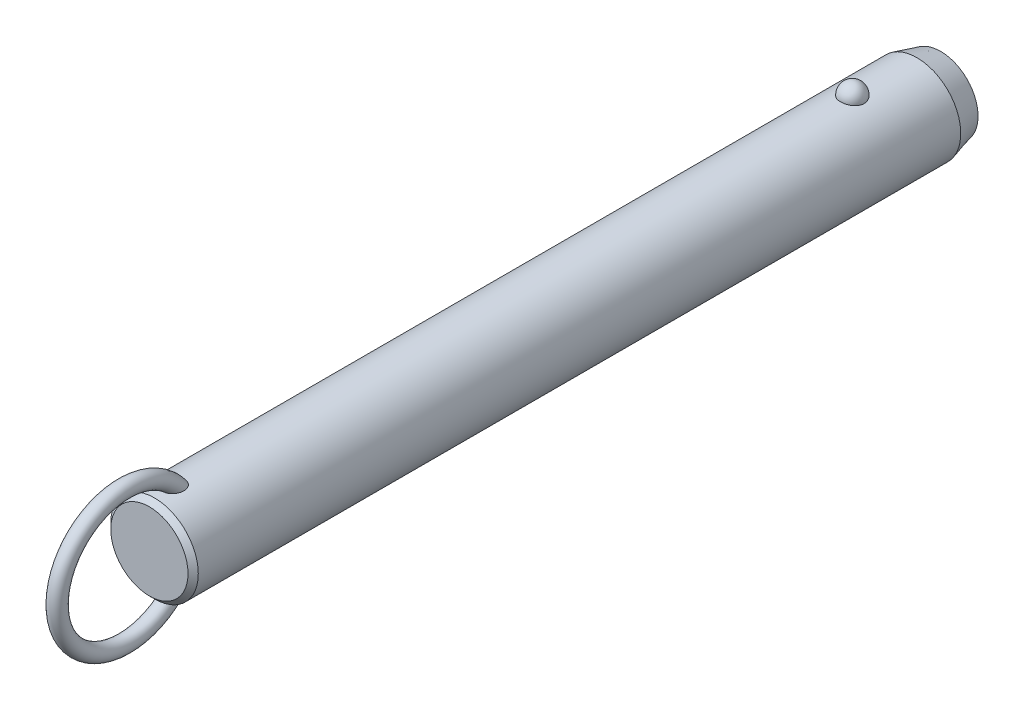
ISO-10303-21;
HEADER;
FILE_DESCRIPTION(('STEP AP214'),'2;1');
FILE_NAME('part.step','',(''),(''),'','','');
FILE_SCHEMA(('AUTOMOTIVE_DESIGN { 1 0 10303 214 1 1 1 1 }'));
ENDSEC;
DATA;
#1=APPLICATION_CONTEXT('core data for automotive mechanical design processes');
#2=APPLICATION_PROTOCOL_DEFINITION('international standard','automotive_design',2000,#1);
#3=PRODUCT_CONTEXT('',#1,'mechanical');
#4=PRODUCT('Part','Part','',(#3));
#5=PRODUCT_RELATED_PRODUCT_CATEGORY('part','',(#4));
#6=PRODUCT_DEFINITION_FORMATION('','',#4);
#7=PRODUCT_DEFINITION_CONTEXT('part definition',#1,'design');
#8=PRODUCT_DEFINITION('design','',#6,#7);
#9=PRODUCT_DEFINITION_SHAPE('','',#8);
#10=(LENGTH_UNIT() NAMED_UNIT(*) SI_UNIT(.MILLI.,.METRE.));
#11=(NAMED_UNIT(*) PLANE_ANGLE_UNIT() SI_UNIT($,.RADIAN.));
#12=(NAMED_UNIT(*) SI_UNIT($,.STERADIAN.) SOLID_ANGLE_UNIT());
#13=UNCERTAINTY_MEASURE_WITH_UNIT(LENGTH_MEASURE(1.E-05),#10,'distance_accuracy_value','');
#14=(GEOMETRIC_REPRESENTATION_CONTEXT(3) GLOBAL_UNCERTAINTY_ASSIGNED_CONTEXT((#13)) GLOBAL_UNIT_ASSIGNED_CONTEXT((#10,
#11,#12)) REPRESENTATION_CONTEXT('',''));
#15=CARTESIAN_POINT('',(0.,0.,0.));
#16=DIRECTION('',(0.,0.,1.));
#17=DIRECTION('',(1.,0.,0.));
#18=AXIS2_PLACEMENT_3D('',#15,#16,#17);
#19=CARTESIAN_POINT('',(0.,0.,162.6));
#20=DIRECTION('',(0.,0.,-1.));
#21=DIRECTION('',(-1.,0.,0.));
#22=AXIS2_PLACEMENT_3D('',#19,#20,#21);
#23=CYLINDRICAL_SURFACE('',#22,11.1);
#24=CARTESIAN_POINT('',(2.9724815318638,10.6945945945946,-3.00000000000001));
#25=CARTESIAN_POINT('',(2.97247830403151,10.6945972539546,-2.8322505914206));
#26=CARTESIAN_POINT('',(2.95876598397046,10.6984356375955,-2.66445972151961));
#27=CARTESIAN_POINT('',(2.90424529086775,10.7133624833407,-2.3336238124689));
#28=CARTESIAN_POINT('',(2.8634252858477,10.7244540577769,-2.17058084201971));
#29=CARTESIAN_POINT('',(2.75573657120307,10.7526272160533,-1.85396767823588));
#30=CARTESIAN_POINT('',(2.68887937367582,10.7697061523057,-1.70039333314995));
#31=CARTESIAN_POINT('',(2.53079696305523,10.8079438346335,-1.4069159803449));
#32=CARTESIAN_POINT('',(2.43957264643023,10.8291024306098,-1.26701246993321));
#33=CARTESIAN_POINT('',(2.23458150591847,10.8732541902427,-1.00409565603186));
#34=CARTESIAN_POINT('',(2.12071295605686,10.8962553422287,-0.881162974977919));
#35=CARTESIAN_POINT('',(1.87365402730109,10.9414421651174,-0.656352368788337));
#36=CARTESIAN_POINT('',(1.74046358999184,10.9636278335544,-0.554474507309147));
#37=CARTESIAN_POINT('',(1.45872188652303,11.0046495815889,-0.374872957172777));
#38=CARTESIAN_POINT('',(1.31021276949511,11.0234944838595,-0.297085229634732));
#39=CARTESIAN_POINT('',(1.00170030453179,11.0557957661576,-0.167529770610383));
#40=CARTESIAN_POINT('',(0.841698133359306,11.0692526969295,-0.1157593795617));
#41=CARTESIAN_POINT('',(0.517607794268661,11.0890932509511,-0.0403925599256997));
#42=CARTESIAN_POINT('',(0.353633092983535,11.0955916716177,-0.0163383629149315));
#43=CARTESIAN_POINT('',(0.0238420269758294,11.1011989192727,0.00445177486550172));
#44=CARTESIAN_POINT('',(-0.141974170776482,11.1003084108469,0.00119017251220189));
#45=CARTESIAN_POINT('',(-0.468405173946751,11.0912990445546,-0.0323233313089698));
#46=CARTESIAN_POINT('',(-0.629059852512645,11.0832767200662,-0.062214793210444));
#47=CARTESIAN_POINT('',(-0.942937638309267,11.0609962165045,-0.147645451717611));
#48=CARTESIAN_POINT('',(-1.09616062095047,11.0467379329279,-0.203185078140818));
#49=CARTESIAN_POINT('',(-1.39181061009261,11.0134071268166,-0.338752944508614));
#50=CARTESIAN_POINT('',(-1.53417383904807,10.9943086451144,-0.418913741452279));
#51=CARTESIAN_POINT('',(-1.80342160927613,10.9533667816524,-0.601448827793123));
#52=CARTESIAN_POINT('',(-1.9303046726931,10.9315231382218,-0.703825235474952));
#53=CARTESIAN_POINT('',(-2.16747598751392,10.887005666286,-0.930091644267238));
#54=CARTESIAN_POINT('',(-2.27742774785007,10.8643239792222,-1.05433291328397));
#55=CARTESIAN_POINT('',(-2.47517316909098,10.8209886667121,-1.31966633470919));
#56=CARTESIAN_POINT('',(-2.56296538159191,10.8003351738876,-1.46075958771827));
#57=CARTESIAN_POINT('',(-2.71500300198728,10.7631304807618,-1.75753646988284));
#58=CARTESIAN_POINT('',(-2.77898901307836,10.7466250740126,-1.91335887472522));
#59=CARTESIAN_POINT('',(-2.88046189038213,10.7198747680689,-2.23391529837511));
#60=CARTESIAN_POINT('',(-2.91794947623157,10.709629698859,-2.3986490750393));
#61=CARTESIAN_POINT('',(-2.96537819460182,10.6965949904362,-2.73165170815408));
#62=CARTESIAN_POINT('',(-2.97542891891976,10.693775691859,-2.89990378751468));
#63=CARTESIAN_POINT('',(-2.96804271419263,10.6958279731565,-3.23575286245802));
#64=CARTESIAN_POINT('',(-2.95060646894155,10.7006993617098,-3.4033498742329));
#65=CARTESIAN_POINT('',(-2.88883358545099,10.71753912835,-3.73233906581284));
#66=CARTESIAN_POINT('',(-2.84462026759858,10.7294749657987,-3.89375610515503));
#67=CARTESIAN_POINT('',(-2.73050447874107,10.7590797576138,-4.20667949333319));
#68=CARTESIAN_POINT('',(-2.66060103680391,10.7767489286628,-4.35818546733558));
#69=CARTESIAN_POINT('',(-2.49642559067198,10.8159599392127,-4.64785421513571));
#70=CARTESIAN_POINT('',(-2.40203047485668,10.8375211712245,-4.78594458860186));
#71=CARTESIAN_POINT('',(-2.19143488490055,10.8820570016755,-5.04410382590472));
#72=CARTESIAN_POINT('',(-2.07523364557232,10.9050316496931,-5.16417205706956));
#73=CARTESIAN_POINT('',(-1.82361254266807,10.9499219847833,-5.3833483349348));
#74=CARTESIAN_POINT('',(-1.68812945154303,10.9718338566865,-5.48238464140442));
#75=CARTESIAN_POINT('',(-1.40191298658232,11.0120611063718,-5.65618873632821));
#76=CARTESIAN_POINT('',(-1.25118062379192,11.0303767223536,-5.73095813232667));
#77=CARTESIAN_POINT('',(-0.940570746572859,11.0611653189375,-5.85334725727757));
#78=CARTESIAN_POINT('',(-0.780821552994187,11.0737044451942,-5.90127578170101));
#79=CARTESIAN_POINT('',(-0.455204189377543,11.0918598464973,-5.96992976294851));
#80=CARTESIAN_POINT('',(-0.289336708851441,11.0974768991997,-5.99065827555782));
#81=CARTESIAN_POINT('',(0.0406846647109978,11.1011307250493,-6.00418773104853));
#82=CARTESIAN_POINT('',(0.204817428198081,11.099299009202,-5.9974731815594));
#83=CARTESIAN_POINT('',(0.5295530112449,11.088551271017,-5.95740317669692));
#84=CARTESIAN_POINT('',(0.69015594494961,11.0796354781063,-5.92404858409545));
#85=CARTESIAN_POINT('',(1.0027760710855,11.0557204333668,-5.83180084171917));
#86=CARTESIAN_POINT('',(1.15482001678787,11.0407414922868,-5.7729929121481));
#87=CARTESIAN_POINT('',(1.44678373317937,11.0062913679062,-5.63147366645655));
#88=CARTESIAN_POINT('',(1.58670279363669,10.9868199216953,-5.54876095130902));
#89=CARTESIAN_POINT('',(1.8527023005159,10.9451315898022,-5.36027644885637));
#90=CARTESIAN_POINT('',(1.97855158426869,10.9228788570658,-5.25418644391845));
#91=CARTESIAN_POINT('',(2.21080872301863,10.8782509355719,-5.02251354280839));
#92=CARTESIAN_POINT('',(2.31721312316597,10.8558757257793,-4.89692718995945));
#93=CARTESIAN_POINT('',(2.5094551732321,10.8130715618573,-4.62745408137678));
#94=CARTESIAN_POINT('',(2.59493284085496,10.7926798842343,-4.48330448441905));
#95=CARTESIAN_POINT('',(2.740862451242,10.7565495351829,-4.18236358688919));
#96=CARTESIAN_POINT('',(2.80132490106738,10.7408089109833,-4.02557762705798));
#97=CARTESIAN_POINT('',(2.88959070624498,10.7173718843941,-3.72475308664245));
#98=CARTESIAN_POINT('',(2.92062102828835,10.7088950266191,-3.58171216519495));
#99=CARTESIAN_POINT('',(2.96206765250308,10.6975052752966,-3.29245795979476));
#100=CARTESIAN_POINT('',(2.97248434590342,10.6945922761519,-3.14624473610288));
#101=CARTESIAN_POINT('',(2.9724815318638,10.6945945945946,-3.00000000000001));
#102=B_SPLINE_CURVE_WITH_KNOTS('',3,(#24,#25,#26,#27,#28,#29,#30,#31,#32,#33,#34,#35,#36,#37,
#38,#39,#40,#41,#42,#43,#44,#45,#46,#47,#48,#49,#50,#51,#52,#53,#54,#55,#56,#57,#58,#59,#60,#61,
#62,#63,#64,#65,#66,#67,#68,#69,#70,#71,#72,#73,#74,#75,#76,#77,#78,#79,#80,#81,#82,#83,#84,#85,
#86,#87,#88,#89,#90,#91,#92,#93,#94,#95,#96,#97,#98,#99,#100,#101),.UNSPECIFIED.,.T.,.F.,(4,2,2,
2,2,2,2,2,2,2,2,2,2,2,2,2,2,2,2,2,2,2,2,2,2,2,2,2,2,2,2,2,2,2,2,2,2,2,4),(0.,0.502722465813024,
1.00566079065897,1.5083769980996,2.01107471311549,2.51608392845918,3.02109467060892,
3.52475118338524,4.02835620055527,4.523518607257,5.0186364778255,5.50715297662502,
5.9956776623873,6.48688002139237,6.97812923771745,7.47814366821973,7.9781907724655,
8.48353712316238,8.9888697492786,9.49218093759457,9.99547960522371,10.4964777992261,
10.997494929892,11.5010810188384,12.0046847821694,12.5099796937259,13.0152411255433,
13.5145635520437,14.0138298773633,14.5043200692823,14.9947943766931,15.4836390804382,
15.9725123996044,16.4685040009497,16.9645836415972,17.4686765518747,17.972557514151,
18.410841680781,18.849117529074),.UNSPECIFIED.);
#103=CARTESIAN_POINT('',(2.9724815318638,10.6945945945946,-3.00000000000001));
#104=VERTEX_POINT('',#103);
#105=EDGE_CURVE('E41',#104,#104,#102,.T.);
#106=ORIENTED_EDGE('',*,*,#105,.T.);
#107=EDGE_LOOP('',(#106));
#108=FACE_BOUND('',#107,.T.);
#109=CARTESIAN_POINT('',(0.,0.,174.));
#110=DIRECTION('',(0.,0.,1.));
#111=DIRECTION('',(1.,0.,0.));
#112=AXIS2_PLACEMENT_3D('',#109,#110,#111);
#113=CIRCLE('',#112,11.1);
#114=CARTESIAN_POINT('',(11.1,0.,174.));
#115=VERTEX_POINT('',#114);
#116=EDGE_CURVE('E10',#115,#115,#113,.F.);
#117=ORIENTED_EDGE('',*,*,#116,.T.);
#118=EDGE_LOOP('',(#117));
#119=FACE_BOUND('',#118,.T.);
#120=CARTESIAN_POINT('',(-0.564520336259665,-11.0856356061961,166.257815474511));
#121=CARTESIAN_POINT('',(-0.667202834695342,-11.0804062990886,166.291283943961));
#122=CARTESIAN_POINT('',(-0.766875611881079,-11.0738877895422,166.333835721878));
#123=CARTESIAN_POINT('',(-0.957284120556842,-11.0590576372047,166.435419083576));
#124=CARTESIAN_POINT('',(-1.04801616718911,-11.0507452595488,166.49445742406));
#125=CARTESIAN_POINT('',(-1.21800952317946,-11.0333016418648,166.626529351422));
#126=CARTESIAN_POINT('',(-1.29730805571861,-11.0241732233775,166.699515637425));
#127=CARTESIAN_POINT('',(-1.44337665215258,-11.0060026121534,166.857037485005));
#128=CARTESIAN_POINT('',(-1.51014622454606,-10.9969604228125,166.941573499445));
#129=CARTESIAN_POINT('',(-1.63454620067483,-10.9791841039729,167.125521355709));
#130=CARTESIAN_POINT('',(-1.69127003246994,-10.9705107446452,167.225549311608));
#131=CARTESIAN_POINT('',(-1.7898078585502,-10.9548648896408,167.432790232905));
#132=CARTESIAN_POINT('',(-1.83161214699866,-10.9478935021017,167.540007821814));
#133=CARTESIAN_POINT('',(-1.91557028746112,-10.9335803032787,167.805408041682));
#134=CARTESIAN_POINT('',(-1.95040620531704,-10.9273269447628,167.965980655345));
#135=CARTESIAN_POINT('',(-1.99388326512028,-10.9194709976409,168.290697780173));
#136=CARTESIAN_POINT('',(-2.00248051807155,-10.9178762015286,168.454847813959));
#137=CARTESIAN_POINT('',(-1.99551615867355,-10.9191578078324,168.824650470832));
#138=CARTESIAN_POINT('',(-1.97322066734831,-10.9232807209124,169.030191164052));
#139=CARTESIAN_POINT('',(-1.91529761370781,-10.9335244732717,169.333595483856));
#140=CARTESIAN_POINT('',(-1.89184575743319,-10.9376266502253,169.434088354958));
#141=CARTESIAN_POINT('',(-1.83700674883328,-10.9469720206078,169.632855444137));
#142=CARTESIAN_POINT('',(-1.80562070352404,-10.9522150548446,169.731129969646));
#143=CARTESIAN_POINT('',(-1.73463055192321,-10.9636837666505,169.925914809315));
#144=CARTESIAN_POINT('',(-1.6949341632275,-10.9699202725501,170.022390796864));
#145=CARTESIAN_POINT('',(-1.60745141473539,-10.9830806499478,170.211626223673));
#146=CARTESIAN_POINT('',(-1.55966150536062,-10.9900048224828,170.304384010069));
#147=CARTESIAN_POINT('',(-1.45591812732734,-11.0042280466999,170.484690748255));
#148=CARTESIAN_POINT('',(-1.40000013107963,-11.0115253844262,170.572260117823));
#149=CARTESIAN_POINT('',(-1.27937470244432,-11.0261911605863,170.741029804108));
#150=CARTESIAN_POINT('',(-1.21467835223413,-11.0335594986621,170.82223795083));
#151=CARTESIAN_POINT('',(-1.08218150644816,-11.0473027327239,170.969001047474));
#152=CARTESIAN_POINT('',(-1.01522633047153,-11.0537063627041,171.035309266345));
#153=CARTESIAN_POINT('',(-0.872952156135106,-11.065850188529,171.158378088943));
#154=CARTESIAN_POINT('',(-0.797642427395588,-11.0715911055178,171.215149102));
#155=CARTESIAN_POINT('',(-0.651396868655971,-11.081071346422,171.307515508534));
#156=CARTESIAN_POINT('',(-0.581712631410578,-11.0849841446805,171.345049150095));
#157=CARTESIAN_POINT('',(-0.437066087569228,-11.0916271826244,171.408259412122));
#158=CARTESIAN_POINT('',(-0.362109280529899,-11.0943586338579,171.433948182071));
#159=CARTESIAN_POINT('',(-0.207828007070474,-11.0983242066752,171.471117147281));
#160=CARTESIAN_POINT('',(-0.12846771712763,-11.0995432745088,171.482454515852));
#161=CARTESIAN_POINT('',(0.0309101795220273,-11.1002423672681,171.488965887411));
#162=CARTESIAN_POINT('',(0.110927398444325,-11.0997233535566,171.484148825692));
#163=CARTESIAN_POINT('',(0.25640659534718,-11.097240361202,171.460959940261));
#164=CARTESIAN_POINT('',(0.322235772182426,-11.0955074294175,171.444754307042));
#165=CARTESIAN_POINT('',(0.450635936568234,-11.0910350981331,171.402600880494));
#166=CARTESIAN_POINT('',(0.513205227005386,-11.0882951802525,171.376648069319));
#167=CARTESIAN_POINT('',(0.662626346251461,-11.0805620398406,171.302607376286));
#168=CARTESIAN_POINT('',(0.747127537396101,-11.0751144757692,171.249845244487));
#169=CARTESIAN_POINT('',(0.906756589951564,-11.0631932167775,171.131720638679));
#170=CARTESIAN_POINT('',(0.981859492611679,-11.0567168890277,171.066325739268));
#171=CARTESIAN_POINT('',(1.10712207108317,-11.0447856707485,170.94226337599));
#172=CARTESIAN_POINT('',(1.15909566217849,-11.0394280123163,170.885383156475));
#173=CARTESIAN_POINT('',(1.25791923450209,-11.0286040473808,170.767327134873));
#174=CARTESIAN_POINT('',(1.30476642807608,-11.0231376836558,170.706149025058));
#175=CARTESIAN_POINT('',(1.43818612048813,-11.0068027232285,170.517305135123));
#176=CARTESIAN_POINT('',(1.51751767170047,-10.9960104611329,170.384453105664));
#177=CARTESIAN_POINT('',(1.63597546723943,-10.9788847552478,170.153137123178));
#178=CARTESIAN_POINT('',(1.67988876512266,-10.9722190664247,170.057053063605));
#179=CARTESIAN_POINT('',(1.75953241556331,-10.9597298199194,169.861431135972));
#180=CARTESIAN_POINT('',(1.79525967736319,-10.9539065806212,169.761891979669));
#181=CARTESIAN_POINT('',(1.85844731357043,-10.9433632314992,169.56021118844));
#182=CARTESIAN_POINT('',(1.8859107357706,-10.9386427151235,169.45807052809));
#183=CARTESIAN_POINT('',(1.93234324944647,-10.9305350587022,169.251819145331));
#184=CARTESIAN_POINT('',(1.95131065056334,-10.9271481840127,169.147708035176));
#185=CARTESIAN_POINT('',(1.9904020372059,-10.9201183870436,168.865458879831));
#186=CARTESIAN_POINT('',(2.00221217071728,-10.9179256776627,168.686037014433));
#187=CARTESIAN_POINT('',(1.99711676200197,-10.9188636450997,168.327713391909));
#188=CARTESIAN_POINT('',(1.98026150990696,-10.9219849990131,168.148811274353));
#189=CARTESIAN_POINT('',(1.92151657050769,-10.9324473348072,167.83645144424));
#190=CARTESIAN_POINT('',(1.88605081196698,-10.9386915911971,167.701759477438));
#191=CARTESIAN_POINT('',(1.79393020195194,-10.9541780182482,167.439966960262));
#192=CARTESIAN_POINT('',(1.73729868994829,-10.9634168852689,167.312858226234));
#193=CARTESIAN_POINT('',(1.61237037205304,-10.9824218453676,167.089418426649));
#194=CARTESIAN_POINT('',(1.54715374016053,-10.9918945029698,166.991345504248));
#195=CARTESIAN_POINT('',(1.40127026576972,-11.0114415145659,166.807434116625));
#196=CARTESIAN_POINT('',(1.3206074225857,-11.0215157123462,166.721592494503));
#197=CARTESIAN_POINT('',(1.1447478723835,-11.041168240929,166.565163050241));
#198=CARTESIAN_POINT('',(1.04947805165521,-11.0507437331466,166.494656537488));
#199=CARTESIAN_POINT('',(0.84727806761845,-11.0680789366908,166.372640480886));
#200=CARTESIAN_POINT('',(0.740351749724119,-11.0758392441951,166.321124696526));
#201=CARTESIAN_POINT('',(0.529289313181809,-11.0878275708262,166.243485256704));
#202=CARTESIAN_POINT('',(0.425895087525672,-11.0923259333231,166.215377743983));
#203=CARTESIAN_POINT('',(0.215723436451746,-11.0984001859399,166.177703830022));
#204=CARTESIAN_POINT('',(0.10894793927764,-11.0999777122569,166.168127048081));
#205=CARTESIAN_POINT('',(-0.0938962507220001,-11.1000196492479,166.167877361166));
#206=CARTESIAN_POINT('',(-0.189967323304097,-11.0987797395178,166.175408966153));
#207=CARTESIAN_POINT('',(-0.379657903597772,-11.0939111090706,166.205507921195));
#208=CARTESIAN_POINT('',(-0.473277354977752,-11.0902823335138,166.228075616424));
#209=CARTESIAN_POINT('',(-0.564520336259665,-11.0856356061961,166.257815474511));
#210=B_SPLINE_CURVE_WITH_KNOTS('',3,(#120,#121,#122,#123,#124,#125,#126,#127,#128,#129,#130,
#131,#132,#133,#134,#135,#136,#137,#138,#139,#140,#141,#142,#143,#144,#145,#146,#147,#148,#149,
#150,#151,#152,#153,#154,#155,#156,#157,#158,#159,#160,#161,#162,#163,#164,#165,#166,#167,#168,
#169,#170,#171,#172,#173,#174,#175,#176,#177,#178,#179,#180,#181,#182,#183,#184,#185,#186,#187,
#188,#189,#190,#191,#192,#193,#194,#195,#196,#197,#198,#199,#200,#201,#202,#203,#204,#205,#206,
#207,#208,#209),.UNSPECIFIED.,.T.,.F.,(4,2,2,2,2,2,2,2,2,2,2,2,2,2,2,2,2,2,2,2,2,2,2,2,2,2,2,2,
2,2,2,2,2,2,2,2,2,2,2,2,2,2,2,2,4),(0.,0.323999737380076,0.648132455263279,0.971184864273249,
1.29424994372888,1.63886237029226,1.98369857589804,2.47426059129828,2.96564271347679,
3.58257396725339,3.89215258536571,4.20168803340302,4.51486273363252,4.82817514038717,
5.14015911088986,5.45175282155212,5.73442856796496,6.01679375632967,6.25364580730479,
6.49025437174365,6.72919963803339,6.96801276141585,7.17061258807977,7.37331685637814,
7.67094989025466,7.96935728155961,8.20075067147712,8.43226927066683,8.89581623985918,
9.21306533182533,9.5304340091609,9.84768549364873,10.1650000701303,10.7022930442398,
11.2386443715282,11.655339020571,12.071575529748,12.4245637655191,12.7774607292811,
13.1321855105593,13.4867936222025,13.8068771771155,14.1267813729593,14.4146787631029,
14.7025827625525),.UNSPECIFIED.);
#211=CARTESIAN_POINT('',(-0.564520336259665,-11.0856356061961,166.257815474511));
#212=VERTEX_POINT('',#211);
#213=EDGE_CURVE('E59',#212,#212,#210,.T.);
#214=ORIENTED_EDGE('',*,*,#213,.T.);
#215=EDGE_LOOP('',(#214));
#216=FACE_BOUND('',#215,.T.);
#217=CARTESIAN_POINT('',(-0.564520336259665,11.0856356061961,166.257815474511));
#218=CARTESIAN_POINT('',(-0.468542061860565,11.0905203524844,166.226545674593));
#219=CARTESIAN_POINT('',(-0.369793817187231,11.0942886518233,166.203157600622));
#220=CARTESIAN_POINT('',(-0.169555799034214,11.0991586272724,166.173085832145));
#221=CARTESIAN_POINT('',(-0.0680604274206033,11.1002543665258,166.16643932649));
#222=CARTESIAN_POINT('',(0.13454973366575,11.099646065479,166.170157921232));
#223=CARTESIAN_POINT('',(0.235664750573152,11.0979441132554,166.18051033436));
#224=CARTESIAN_POINT('',(0.434632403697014,11.0919342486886,166.217831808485));
#225=CARTESIAN_POINT('',(0.532486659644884,11.0876276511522,166.244792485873));
#226=CARTESIAN_POINT('',(0.722445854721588,11.0768742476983,166.3144096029));
#227=CARTESIAN_POINT('',(0.814543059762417,11.0704246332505,166.357086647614));
#228=CARTESIAN_POINT('',(0.990565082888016,11.0560659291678,166.456648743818));
#229=CARTESIAN_POINT('',(1.07448844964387,11.048156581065,166.513536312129));
#230=CARTESIAN_POINT('',(1.23562672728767,11.0313221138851,166.642210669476));
#231=CARTESIAN_POINT('',(1.3124268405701,11.0223686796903,166.714511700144));
#232=CARTESIAN_POINT('',(1.45398030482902,11.0045918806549,166.870042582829));
#233=CARTESIAN_POINT('',(1.51873073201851,10.9957685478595,166.953275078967));
#234=CARTESIAN_POINT('',(1.64107232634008,10.9782087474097,167.136384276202));
#235=CARTESIAN_POINT('',(1.6974317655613,10.9695572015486,167.237089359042));
#236=CARTESIAN_POINT('',(1.79515063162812,10.9539887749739,167.445626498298));
#237=CARTESIAN_POINT('',(1.83649966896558,10.9470730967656,167.55346343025));
#238=CARTESIAN_POINT('',(1.91931148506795,10.9329211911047,167.820399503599));
#239=CARTESIAN_POINT('',(1.95340104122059,10.9267904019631,167.981861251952));
#240=CARTESIAN_POINT('',(1.99526195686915,10.9192174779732,168.30821631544));
#241=CARTESIAN_POINT('',(2.00298989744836,10.9177830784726,168.47311484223));
#242=CARTESIAN_POINT('',(1.99396251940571,10.9194420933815,168.844100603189));
#243=CARTESIAN_POINT('',(1.97050829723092,10.923774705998,169.05003871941));
#244=CARTESIAN_POINT('',(1.91079643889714,10.9343131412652,169.353901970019));
#245=CARTESIAN_POINT('',(1.88673702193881,10.9385106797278,169.454529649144));
#246=CARTESIAN_POINT('',(1.8306550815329,10.9480376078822,169.653510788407));
#247=CARTESIAN_POINT('',(1.79863369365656,10.9533668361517,169.751864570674));
#248=CARTESIAN_POINT('',(1.72633365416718,10.9649954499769,169.946720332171));
#249=CARTESIAN_POINT('',(1.68596409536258,10.9713053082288,170.04318790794));
#250=CARTESIAN_POINT('',(1.59707998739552,10.9845964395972,170.232323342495));
#251=CARTESIAN_POINT('',(1.54856169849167,10.9915780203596,170.324989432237));
#252=CARTESIAN_POINT('',(1.44330168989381,11.0058935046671,170.504975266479));
#253=CARTESIAN_POINT('',(1.38659749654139,11.0132257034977,170.592316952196));
#254=CARTESIAN_POINT('',(1.26431158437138,11.0279330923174,170.760456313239));
#255=CARTESIAN_POINT('',(1.198741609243,11.0353082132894,170.841262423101));
#256=CARTESIAN_POINT('',(1.06542088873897,11.048931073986,170.985985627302));
#257=CARTESIAN_POINT('',(0.998640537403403,11.0552153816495,171.050784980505));
#258=CARTESIAN_POINT('',(0.856896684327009,11.0671032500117,171.170846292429));
#259=CARTESIAN_POINT('',(0.781942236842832,11.0727075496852,171.226118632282));
#260=CARTESIAN_POINT('',(0.636276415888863,11.081949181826,171.315972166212));
#261=CARTESIAN_POINT('',(0.566755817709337,11.0857572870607,171.352441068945));
#262=CARTESIAN_POINT('',(0.42260242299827,11.0921860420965,171.413533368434));
#263=CARTESIAN_POINT('',(0.347974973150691,11.0948079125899,171.438168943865));
#264=CARTESIAN_POINT('',(0.194593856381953,11.0985608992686,171.473323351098));
#265=CARTESIAN_POINT('',(0.115807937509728,11.0996777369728,171.483706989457));
#266=CARTESIAN_POINT('',(-0.0422499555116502,11.1002003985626,171.488574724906));
#267=CARTESIAN_POINT('',(-0.121521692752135,11.09960699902,171.483066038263));
#268=CARTESIAN_POINT('',(-0.266046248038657,11.0970123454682,171.458827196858));
#269=CARTESIAN_POINT('',(-0.331661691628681,11.0952283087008,171.442135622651));
#270=CARTESIAN_POINT('',(-0.45958809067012,11.0906663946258,171.399111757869));
#271=CARTESIAN_POINT('',(-0.52189737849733,11.0878880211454,171.372774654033));
#272=CARTESIAN_POINT('',(-0.671446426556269,11.0800342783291,171.297513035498));
#273=CARTESIAN_POINT('',(-0.756250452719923,11.0744969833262,171.243818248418));
#274=CARTESIAN_POINT('',(-0.916349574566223,11.0624045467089,171.123802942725));
#275=CARTESIAN_POINT('',(-0.991618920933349,11.0558467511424,171.057449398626));
#276=CARTESIAN_POINT('',(-1.11713140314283,11.0437783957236,170.931633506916));
#277=CARTESIAN_POINT('',(-1.16920539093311,11.0383619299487,170.873952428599));
#278=CARTESIAN_POINT('',(-1.26817476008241,11.02743010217,170.754280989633));
#279=CARTESIAN_POINT('',(-1.31506731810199,11.0219146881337,170.692288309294));
#280=CARTESIAN_POINT('',(-1.40399813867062,11.0109399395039,170.564784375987));
#281=CARTESIAN_POINT('',(-1.44602864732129,11.0054807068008,170.499267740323));
#282=CARTESIAN_POINT('',(-1.52538779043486,10.9947621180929,170.365422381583));
#283=CARTESIAN_POINT('',(-1.56271516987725,10.9895028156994,170.297092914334));
#284=CARTESIAN_POINT('',(-1.64537943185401,10.9774790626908,170.133210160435));
#285=CARTESIAN_POINT('',(-1.68879497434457,10.9708503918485,170.0366735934));
#286=CARTESIAN_POINT('',(-1.76740738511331,10.9584602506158,169.840236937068));
#287=CARTESIAN_POINT('',(-1.80260120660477,10.95269910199,169.74033561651));
#288=CARTESIAN_POINT('',(-1.86468657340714,10.9423003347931,169.537966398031));
#289=CARTESIAN_POINT('',(-1.8915816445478,10.9376622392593,169.435499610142));
#290=CARTESIAN_POINT('',(-1.93682458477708,10.9297405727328,169.228642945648));
#291=CARTESIAN_POINT('',(-1.95517082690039,10.9264572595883,169.124252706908));
#292=CARTESIAN_POINT('',(-1.99232562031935,10.9197647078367,168.84262876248));
#293=CARTESIAN_POINT('',(-2.00294603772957,10.9177914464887,168.664185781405));
#294=CARTESIAN_POINT('',(-1.99566675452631,10.9191290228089,168.307996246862));
#295=CARTESIAN_POINT('',(-1.97781651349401,10.9224306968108,168.13024902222));
#296=CARTESIAN_POINT('',(-1.91747214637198,10.9331592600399,167.819792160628));
#297=CARTESIAN_POINT('',(-1.88131022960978,10.9395108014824,167.685825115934));
#298=CARTESIAN_POINT('',(-1.78790380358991,10.9551659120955,167.42559757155));
#299=CARTESIAN_POINT('',(-1.7306830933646,10.9644661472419,167.299328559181));
#300=CARTESIAN_POINT('',(-1.60475573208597,10.9835398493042,167.07741565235));
#301=CARTESIAN_POINT('',(-1.53908879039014,10.9930297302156,166.980026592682));
#302=CARTESIAN_POINT('',(-1.39238608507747,11.0125708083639,166.797525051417));
#303=CARTESIAN_POINT('',(-1.31135150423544,11.0226219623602,166.712411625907));
#304=CARTESIAN_POINT('',(-1.14382035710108,11.0411991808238,166.56529943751));
#305=CARTESIAN_POINT('',(-1.0585850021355,11.0497792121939,166.50186930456));
#306=CARTESIAN_POINT('',(-0.878723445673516,11.0655285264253,166.390250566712));
#307=CARTESIAN_POINT('',(-0.784123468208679,11.0727015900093,166.342020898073));
#308=CARTESIAN_POINT('',(-0.646163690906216,11.0812501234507,166.286023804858));
#309=CARTESIAN_POINT('',(-0.605595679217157,11.0835451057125,166.271197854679));
#310=CARTESIAN_POINT('',(-0.564520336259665,11.0856356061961,166.257815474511));
#311=B_SPLINE_CURVE_WITH_KNOTS('',3,(#217,#218,#219,#220,#221,#222,#223,#224,#225,#226,#227,
#228,#229,#230,#231,#232,#233,#234,#235,#236,#237,#238,#239,#240,#241,#242,#243,#244,#245,#246,
#247,#248,#249,#250,#251,#252,#253,#254,#255,#256,#257,#258,#259,#260,#261,#262,#263,#264,#265,
#266,#267,#268,#269,#270,#271,#272,#273,#274,#275,#276,#277,#278,#279,#280,#281,#282,#283,#284,
#285,#286,#287,#288,#289,#290,#291,#292,#293,#294,#295,#296,#297,#298,#299,#300,#301,#302,#303,
#304,#305,#306,#307,#308,#309,#310),.UNSPECIFIED.,.T.,.F.,(4,2,2,2,2,2,2,2,2,2,2,2,2,2,2,2,2,2,
2,2,2,2,2,2,2,2,2,2,2,2,2,2,2,2,2,2,2,2,2,2,2,2,2,2,2,2,4),(0.,0.303061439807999,
0.606795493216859,0.910302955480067,1.21365733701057,1.51741085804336,1.82121821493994,
2.13745205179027,2.45376252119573,2.79958678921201,3.14564996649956,3.63832391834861,
4.13180893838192,4.75031912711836,5.06071926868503,5.37107516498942,5.68500772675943,
5.99908475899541,6.31176519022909,6.62403542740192,6.90315673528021,7.18197194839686,
7.41687778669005,7.65154134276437,7.88841587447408,8.12518286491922,8.32752842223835,
8.52997509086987,8.82986421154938,9.13054668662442,9.36393502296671,9.59744991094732,
9.83133221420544,10.0652767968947,10.3830324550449,10.7009056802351,11.0186436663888,
11.3364420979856,11.8705925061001,12.4038159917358,12.8189662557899,13.2336487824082,
13.5857049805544,13.9377340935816,14.2561354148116,14.5736690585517,14.7033687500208),.UNSPECIFIED.);
#312=CARTESIAN_POINT('',(-0.564520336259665,11.0856356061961,166.257815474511));
#313=VERTEX_POINT('',#312);
#314=EDGE_CURVE('E67',#313,#313,#311,.T.);
#315=ORIENTED_EDGE('',*,*,#314,.T.);
#316=EDGE_LOOP('',(#315));
#317=FACE_BOUND('',#316,.T.);
#318=CARTESIAN_POINT('',(0.,0.,-19.3999999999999));
#319=DIRECTION('',(0.,0.,-1.));
#320=DIRECTION('',(-1.,0.,0.));
#321=AXIS2_PLACEMENT_3D('',#318,#319,#320);
#322=CIRCLE('',#321,11.1);
#323=CARTESIAN_POINT('',(-11.1,0.,-19.3999999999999));
#324=VERTEX_POINT('',#323);
#325=EDGE_CURVE('E56',#324,#324,#322,.F.);
#326=ORIENTED_EDGE('',*,*,#325,.T.);
#327=EDGE_LOOP('',(#326));
#328=FACE_BOUND('',#327,.T.);
#329=ADVANCED_FACE('F37',(#108,#119,#216,#317,#328),#23,.T.);
#330=CARTESIAN_POINT('',(0.,0.,-25.4));
#331=DIRECTION('',(0.,0.,-1.));
#332=DIRECTION('',(-1.,0.,0.));
#333=AXIS2_PLACEMENT_3D('',#330,#331,#332);
#334=PLANE('',#333);
#335=CARTESIAN_POINT('',(0.,0.,-25.4));
#336=DIRECTION('',(0.,0.,-1.));
#337=DIRECTION('',(-1.,0.,0.));
#338=AXIS2_PLACEMENT_3D('',#335,#336,#337);
#339=CIRCLE('',#338,9.49230484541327);
#340=CARTESIAN_POINT('',(-9.49230484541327,0.,-25.4));
#341=VERTEX_POINT('',#340);
#342=EDGE_CURVE('E66',#341,#341,#339,.T.);
#343=ORIENTED_EDGE('',*,*,#342,.T.);
#344=EDGE_LOOP('',(#343));
#345=FACE_BOUND('',#344,.T.);
#346=ADVANCED_FACE('F85',(#345),#334,.T.);
#347=CARTESIAN_POINT('',(0.,0.,-25.4));
#348=DIRECTION('',(0.,0.,1.));
#349=DIRECTION('',(1.,0.,0.));
#350=AXIS2_PLACEMENT_3D('',#347,#348,#349);
#351=CONICAL_SURFACE('',#350,9.49230484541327,0.261799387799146);
#352=ORIENTED_EDGE('',*,*,#325,.F.);
#353=EDGE_LOOP('',(#352));
#354=FACE_BOUND('',#353,.T.);
#355=ORIENTED_EDGE('',*,*,#342,.F.);
#356=EDGE_LOOP('',(#355));
#357=FACE_BOUND('',#356,.T.);
#358=ADVANCED_FACE('F83',(#354,#357),#351,.T.);
#359=CARTESIAN_POINT('',(0.,0.,175.3));
#360=DIRECTION('',(0.,0.,1.));
#361=DIRECTION('',(1.,0.,0.));
#362=AXIS2_PLACEMENT_3D('',#359,#360,#361);
#363=PLANE('',#362);
#364=CARTESIAN_POINT('',(0.,0.,175.3));
#365=DIRECTION('',(0.,0.,1.));
#366=DIRECTION('',(1.,0.,0.));
#367=AXIS2_PLACEMENT_3D('',#364,#365,#366);
#368=CIRCLE('',#367,9.8);
#369=CARTESIAN_POINT('',(9.8,0.,175.3));
#370=VERTEX_POINT('',#369);
#371=EDGE_CURVE('E50',#370,#370,#368,.T.);
#372=ORIENTED_EDGE('',*,*,#371,.T.);
#373=EDGE_LOOP('',(#372));
#374=FACE_BOUND('',#373,.T.);
#375=ADVANCED_FACE('F77',(#374),#363,.T.);
#376=CARTESIAN_POINT('',(0.,0.,181.65));
#377=DIRECTION('',(1.,0.,0.));
#378=DIRECTION('',(0.,0.,-1.));
#379=AXIS2_PLACEMENT_3D('',#376,#377,#378);
#380=TOROIDAL_SURFACE('',#379,17.05,2.);
#381=ORIENTED_EDGE('',*,*,#314,.F.);
#382=EDGE_LOOP('',(#381));
#383=FACE_BOUND('',#382,.T.);
#384=ORIENTED_EDGE('',*,*,#213,.F.);
#385=EDGE_LOOP('',(#384));
#386=FACE_BOUND('',#385,.T.);
#387=ADVANCED_FACE('F73',(#383,#386),#380,.T.);
#388=CARTESIAN_POINT('',(0.,0.,175.3));
#389=DIRECTION('',(0.,0.,-1.));
#390=DIRECTION('',(-1.,0.,0.));
#391=AXIS2_PLACEMENT_3D('',#388,#389,#390);
#392=CONICAL_SURFACE('',#391,9.8,0.785398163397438);
#393=ORIENTED_EDGE('',*,*,#116,.F.);
#394=EDGE_LOOP('',(#393));
#395=FACE_BOUND('',#394,.T.);
#396=ORIENTED_EDGE('',*,*,#371,.F.);
#397=EDGE_LOOP('',(#396));
#398=FACE_BOUND('',#397,.T.);
#399=ADVANCED_FACE('F39',(#395,#398),#392,.T.);
#400=CARTESIAN_POINT('',(0.,11.1,-3.00000000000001));
#401=DIRECTION('',(0.,1.,0.));
#402=DIRECTION('',(0.,0.,-1.));
#403=AXIS2_PLACEMENT_3D('',#400,#401,#402);
#404=SPHERICAL_SURFACE('',#403,3.);
#405=ORIENTED_EDGE('',*,*,#105,.F.);
#406=EDGE_LOOP('',(#405));
#407=FACE_BOUND('',#406,.T.);
#408=ADVANCED_FACE('F79',(#407),#404,.T.);
#409=CLOSED_SHELL('',(#329,#346,#358,#375,#387,#399,#408));
#410=MANIFOLD_SOLID_BREP('B2',#409);
#411=ADVANCED_BREP_SHAPE_REPRESENTATION('',(#18,#410),#14);
#412=SHAPE_DEFINITION_REPRESENTATION(#9,#411);
ENDSEC;
END-ISO-10303-21;
